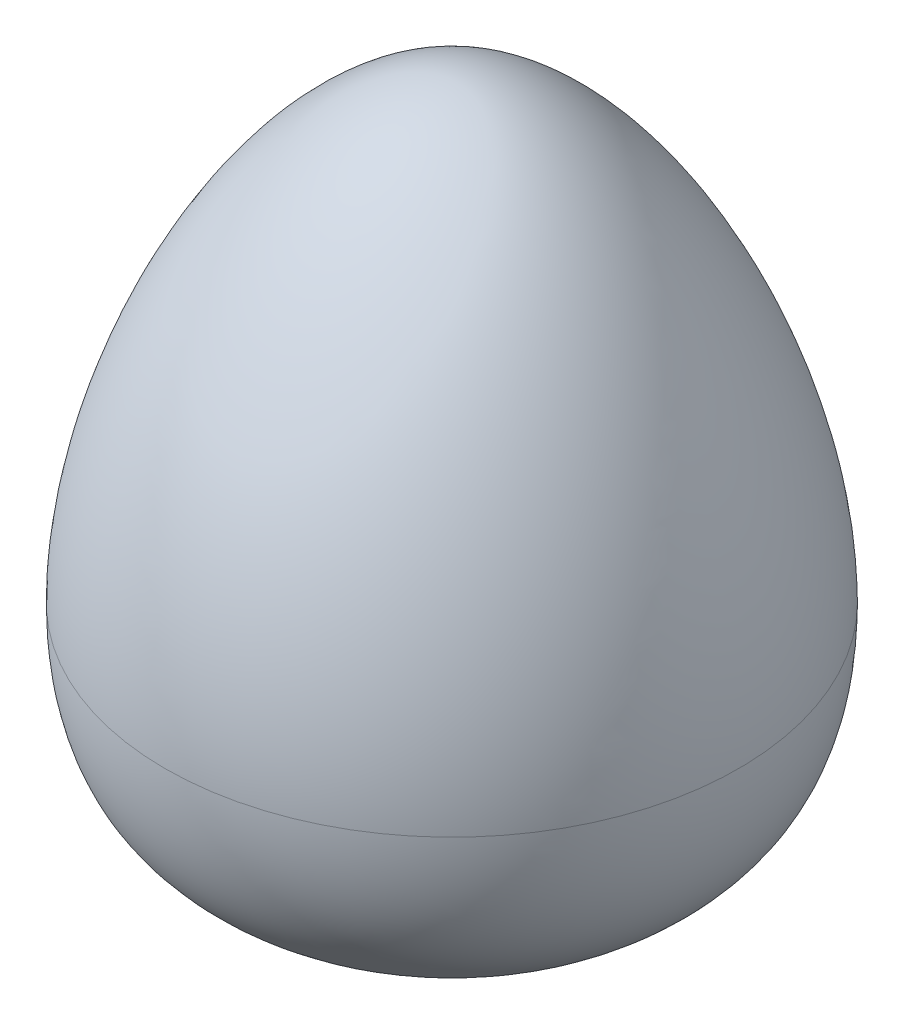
ISO-10303-21;
HEADER;
FILE_DESCRIPTION(('STEP AP214'),'2;1');
FILE_NAME('part.step','',(''),(''),'','','');
FILE_SCHEMA(('AUTOMOTIVE_DESIGN { 1 0 10303 214 1 1 1 1 }'));
ENDSEC;
DATA;
#1=APPLICATION_CONTEXT('core data for automotive mechanical design processes');
#2=APPLICATION_PROTOCOL_DEFINITION('international standard','automotive_design',2000,#1);
#3=PRODUCT_CONTEXT('',#1,'mechanical');
#4=PRODUCT('Part','Part','',(#3));
#5=PRODUCT_RELATED_PRODUCT_CATEGORY('part','',(#4));
#6=PRODUCT_DEFINITION_FORMATION('','',#4);
#7=PRODUCT_DEFINITION_CONTEXT('part definition',#1,'design');
#8=PRODUCT_DEFINITION('design','',#6,#7);
#9=PRODUCT_DEFINITION_SHAPE('','',#8);
#10=(LENGTH_UNIT() NAMED_UNIT(*) SI_UNIT(.MILLI.,.METRE.));
#11=(NAMED_UNIT(*) PLANE_ANGLE_UNIT() SI_UNIT($,.RADIAN.));
#12=(NAMED_UNIT(*) SI_UNIT($,.STERADIAN.) SOLID_ANGLE_UNIT());
#13=UNCERTAINTY_MEASURE_WITH_UNIT(LENGTH_MEASURE(1.E-05),#10,'distance_accuracy_value','');
#14=(GEOMETRIC_REPRESENTATION_CONTEXT(3) GLOBAL_UNCERTAINTY_ASSIGNED_CONTEXT((#13)) GLOBAL_UNIT_ASSIGNED_CONTEXT((#10,
#11,#12)) REPRESENTATION_CONTEXT('',''));
#15=CARTESIAN_POINT('',(0.,0.,0.));
#16=DIRECTION('',(0.,0.,1.));
#17=DIRECTION('',(1.,0.,0.));
#18=AXIS2_PLACEMENT_3D('',#15,#16,#17);
#19=CARTESIAN_POINT('',(0.,77.043433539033,0.));
#20=CARTESIAN_POINT('',(-20.0029015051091,77.043433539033,0.));
#21=CARTESIAN_POINT('',(-50.248034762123,8.80219365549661,0.));
#22=CARTESIAN_POINT('',(-9.98010683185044,0.,0.));
#23=CARTESIAN_POINT('',(0.,0.,0.));
#24=B_SPLINE_CURVE_WITH_KNOTS('',3,(#19,#20,#21,#22,#23),.UNSPECIFIED.,.F.,.F.,(4,1,4),(0.,
0.661391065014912,1.),.UNSPECIFIED.);
#25=CARTESIAN_POINT('',(0.,0.,0.));
#26=DIRECTION('',(0.,-1.,0.));
#27=AXIS1_PLACEMENT('',#25,#26);
#28=SURFACE_OF_REVOLUTION('',#24,#27);
#29=CARTESIAN_POINT('',(0.,77.043433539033,0.));
#30=VERTEX_POINT('',#29);
#31=VERTEX_LOOP('',#30);
#32=FACE_BOUND('',#31,.T.);
#33=CARTESIAN_POINT('',(0.,26.3828358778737,0.));
#34=DIRECTION('',(0.,1.,0.));
#35=DIRECTION('',(0.,0.,1.));
#36=AXIS2_PLACEMENT_3D('',#33,#34,#35);
#37=CIRCLE('',#36,32.2177190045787);
#38=CARTESIAN_POINT('',(0.,26.3828358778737,32.2177190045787));
#39=VERTEX_POINT('',#38);
#40=EDGE_CURVE('E11',#39,#39,#37,.T.);
#41=ORIENTED_EDGE('',*,*,#40,.T.);
#42=EDGE_LOOP('',(#41));
#43=FACE_BOUND('',#42,.T.);
#44=ADVANCED_FACE('F34',(#32,#43),#28,.T.);
#45=ORIENTED_EDGE('',*,*,#40,.F.);
#46=EDGE_LOOP('',(#45));
#47=FACE_BOUND('',#46,.T.);
#48=CARTESIAN_POINT('',(0.,0.,0.));
#49=VERTEX_POINT('',#48);
#50=VERTEX_LOOP('',#49);
#51=FACE_BOUND('',#50,.T.);
#52=ADVANCED_FACE('F36',(#47,#51),#28,.T.);
#53=CLOSED_SHELL('',(#44,#52));
#54=MANIFOLD_SOLID_BREP('B2',#53);
#55=ADVANCED_BREP_SHAPE_REPRESENTATION('',(#18,#54),#14);
#56=SHAPE_DEFINITION_REPRESENTATION(#9,#55);
ENDSEC;
END-ISO-10303-21;
